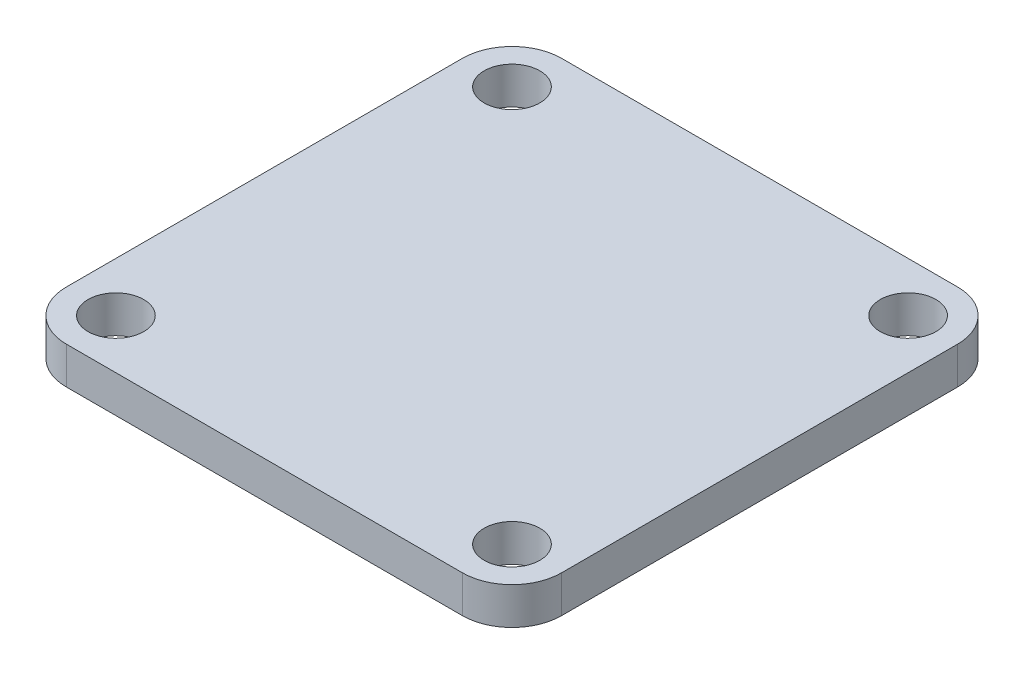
from build123d import *

# Parameters (mm, degrees)
SKETCH1_R           = 2.25
BOSS_EXTRUDE1_DEPTH = 3


with BuildPart() as part:
    # Sketch1 → Boss-Extrude1 (new body)
    with BuildSketch(Plane(origin=(0, 0, 0), x_dir=(1, 0, 0), z_dir=(0, 1, 0))):
        with BuildLine():
            Line((-16, 20), (16, 20))
            ThreePointArc((16, 20), (18.828427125, 18.828427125), (20, 16))
            Line((20, 16), (20, -16))
            ThreePointArc((20, -16), (18.828427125, -18.828427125), (16, -20))
            Line((16, -20), (-16, -20))
            ThreePointArc((-16, -20), (-18.828427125, -18.828427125), (-20, -16))
            Line((-20, -16), (-20, 16))
            ThreePointArc((-20, 16), (-18.828427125, 18.828427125), (-16, 20))
        make_face()
        with Locations(Location((-16, 16, 0), (0, 0, 270))):
            Circle(SKETCH1_R, mode=Mode.SUBTRACT)
        with Locations(Location((16, 16, 0), (0, 0, 270))):
            Circle(SKETCH1_R, mode=Mode.SUBTRACT)
        with Locations(Location((-16, -16, 0), (0, 0, 270))):
            Circle(SKETCH1_R, mode=Mode.SUBTRACT)
        with Locations(Location((16, -16, 0), (0, 0, 270))):
            Circle(SKETCH1_R, mode=Mode.SUBTRACT)
    extrude(amount=BOSS_EXTRUDE1_DEPTH)


solid = part.part
